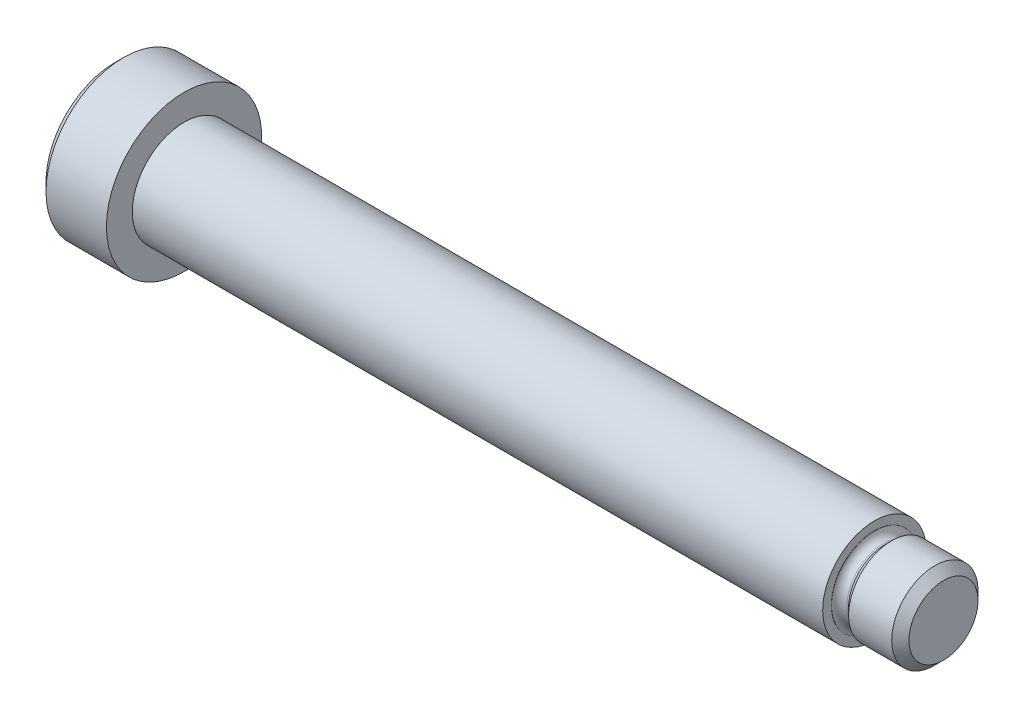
from build123d import *

# Parameters (mm, degrees)
CHANFREIN1_SIZE         = 0.5
ENL_V_MAT_EXTRU_1_DEPTH = 3


with BuildPart() as part:
    # Esquisse1 → R_volution1 (revolve)
    with BuildSketch(Plane.XY, mode=Mode.PRIVATE) as r_volution1_sk:
        Polygon((0, 0), (0, 4.5), (4, 4.5), (4, 3), (44, 3), (44, 2.5), (48, 2.5), (48, 0), align=None)
    revolve(r_volution1_sk.sketch.rotate(Axis((0, 0, 0), (1, 0, 0)), 90), axis=Axis((0, 0, 0), (1, 0, 0)))

    # Chanfrein1
    chanfrein1_edges = [part.edges().sort_by_distance(p)[0] for p in [
        (48, 0, -2.5),
        (0, 0, -4.5),
    ]]
    chamfer(chanfrein1_edges, length=CHANFREIN1_SIZE)

    # Esquisse2 → Enl_v. mat.-Extru.1 (cut)
    with BuildSketch(Plane.ZY):
        Polygon((0, -2.367136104), (2.05, -1.183568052), (2.05, 1.183568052), (0, 2.367136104), (-2.05, 1.183568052), (-2.05, -1.183568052), align=None)
    extrude(amount=-ENL_V_MAT_EXTRU_1_DEPTH, mode=Mode.SUBTRACT)

    # Esquisse3 → Enl_vement de mati_re-R_volution1 (revolve, cut)
    with BuildSketch(Plane(origin=(0, 0, 0), x_dir=(1, 0, 0), z_dir=(0, 1, 0)), mode=Mode.PRIVATE) as enl_vement_de_mati_re_r_volution1_sk:
        with BuildLine():
            Line((44, 3), (44, 2.6))
            ThreePointArc((44, 2.6), (44.146446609, 2.246446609), (44.5, 2.1))
            Line((44.5, 2.1), (44.6, 2.1))
            Line((44.6, 2.1), (45, 2.5))
            Line((45, 2.5), (45, 3))
            Line((45, 3), (44, 3))
        make_face()
    revolve(enl_vement_de_mati_re_r_volution1_sk.sketch.rotate(Axis((0, 0, 0), (1, 0, 0)), 180), axis=Axis((0, 0, 0), (1, 0, 0)), mode=Mode.SUBTRACT)


solid = part.part
